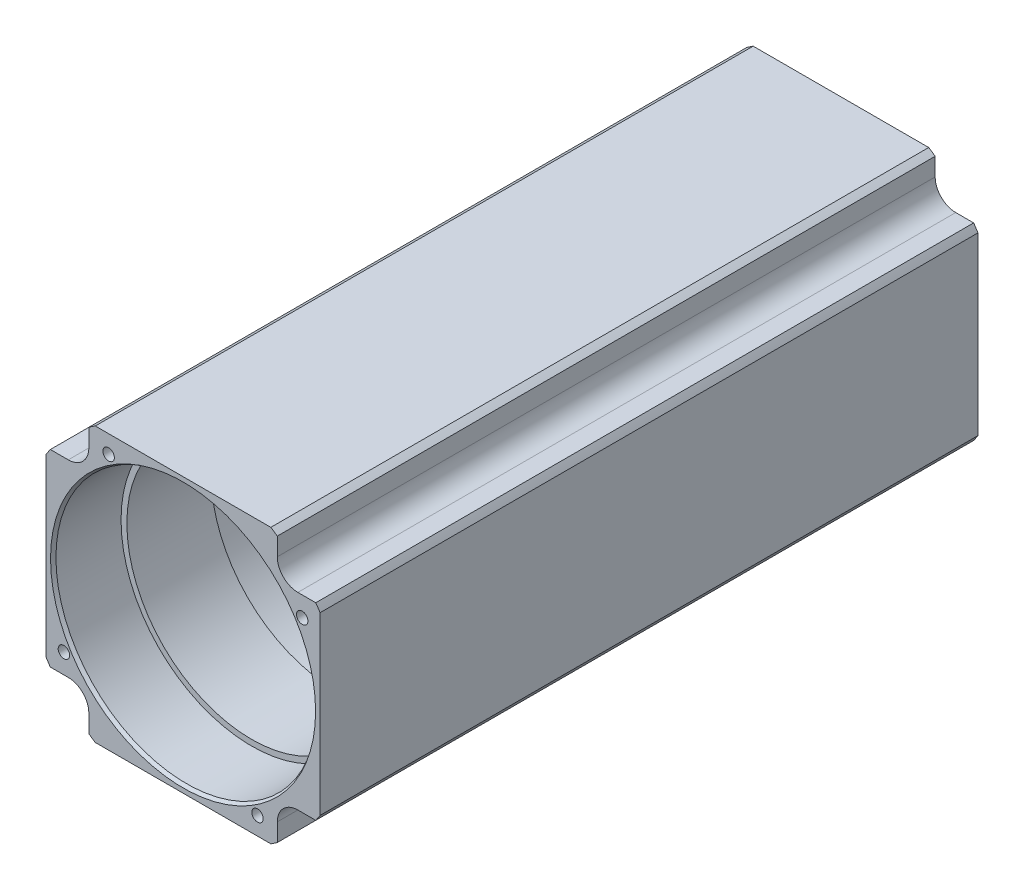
ISO-10303-21;
HEADER;
FILE_DESCRIPTION(('STEP AP214'),'2;1');
FILE_NAME('part.step','',(''),(''),'','','');
FILE_SCHEMA(('AUTOMOTIVE_DESIGN { 1 0 10303 214 1 1 1 1 }'));
ENDSEC;
DATA;
#1=APPLICATION_CONTEXT('core data for automotive mechanical design processes');
#2=APPLICATION_PROTOCOL_DEFINITION('international standard','automotive_design',2000,#1);
#3=PRODUCT_CONTEXT('',#1,'mechanical');
#4=PRODUCT('Part','Part','',(#3));
#5=PRODUCT_RELATED_PRODUCT_CATEGORY('part','',(#4));
#6=PRODUCT_DEFINITION_FORMATION('','',#4);
#7=PRODUCT_DEFINITION_CONTEXT('part definition',#1,'design');
#8=PRODUCT_DEFINITION('design','',#6,#7);
#9=PRODUCT_DEFINITION_SHAPE('','',#8);
#10=(LENGTH_UNIT() NAMED_UNIT(*) SI_UNIT(.MILLI.,.METRE.));
#11=(NAMED_UNIT(*) PLANE_ANGLE_UNIT() SI_UNIT($,.RADIAN.));
#12=(NAMED_UNIT(*) SI_UNIT($,.STERADIAN.) SOLID_ANGLE_UNIT());
#13=UNCERTAINTY_MEASURE_WITH_UNIT(LENGTH_MEASURE(1.E-05),#10,'distance_accuracy_value','');
#14=(GEOMETRIC_REPRESENTATION_CONTEXT(3) GLOBAL_UNCERTAINTY_ASSIGNED_CONTEXT((#13)) GLOBAL_UNIT_ASSIGNED_CONTEXT((#10,
#11,#12)) REPRESENTATION_CONTEXT('',''));
#15=CARTESIAN_POINT('',(0.,0.,0.));
#16=DIRECTION('',(0.,0.,1.));
#17=DIRECTION('',(1.,0.,0.));
#18=AXIS2_PLACEMENT_3D('',#15,#16,#17);
#19=CARTESIAN_POINT('',(17.3849859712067,10.8633449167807,87.9999999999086));
#20=DIRECTION('',(0.,0.,1.));
#21=DIRECTION('',(1.,0.,0.));
#22=AXIS2_PLACEMENT_3D('',#19,#20,#21);
#23=CONICAL_SURFACE('',#22,0.83759999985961,1.0297442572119);
#24=CARTESIAN_POINT('',(17.3849859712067,10.8633449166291,87.4967191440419));
#25=VERTEX_POINT('',#24);
#26=VERTEX_LOOP('',#25);
#27=FACE_BOUND('',#26,.T.);
#28=CARTESIAN_POINT('',(17.3849859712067,10.8633449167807,88.));
#29=DIRECTION('',(0.,0.,-1.));
#30=DIRECTION('',(-1.,0.,0.));
#31=AXIS2_PLACEMENT_3D('',#28,#29,#30);
#32=CIRCLE('',#31,0.8376);
#33=CARTESIAN_POINT('',(16.5473859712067,10.8633449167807,88.));
#34=VERTEX_POINT('',#33);
#35=EDGE_CURVE('E333',#34,#34,#32,.F.);
#36=ORIENTED_EDGE('',*,*,#35,.T.);
#37=EDGE_LOOP('',(#36));
#38=FACE_BOUND('',#37,.T.);
#39=ADVANCED_FACE('F17',(#27,#38),#23,.F.);
#40=CARTESIAN_POINT('',(10.8633449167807,-17.3849859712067,87.9999999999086));
#41=DIRECTION('',(0.,0.,1.));
#42=DIRECTION('',(1.,0.,0.));
#43=AXIS2_PLACEMENT_3D('',#40,#41,#42);
#44=CONICAL_SURFACE('',#43,0.83759999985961,1.0297442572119);
#45=CARTESIAN_POINT('',(10.8633449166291,-17.3849859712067,87.4967191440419));
#46=VERTEX_POINT('',#45);
#47=VERTEX_LOOP('',#46);
#48=FACE_BOUND('',#47,.T.);
#49=CARTESIAN_POINT('',(10.8633449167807,-17.3849859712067,88.));
#50=DIRECTION('',(0.,0.,-1.));
#51=DIRECTION('',(-1.,0.,0.));
#52=AXIS2_PLACEMENT_3D('',#49,#50,#51);
#53=CIRCLE('',#52,0.8376);
#54=CARTESIAN_POINT('',(10.0257449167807,-17.3849859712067,88.));
#55=VERTEX_POINT('',#54);
#56=EDGE_CURVE('E328',#55,#55,#53,.F.);
#57=ORIENTED_EDGE('',*,*,#56,.T.);
#58=EDGE_LOOP('',(#57));
#59=FACE_BOUND('',#58,.T.);
#60=ADVANCED_FACE('F655',(#48,#59),#44,.F.);
#61=CARTESIAN_POINT('',(-17.3849859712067,-10.8633449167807,87.9999999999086));
#62=DIRECTION('',(0.,0.,1.));
#63=DIRECTION('',(1.,0.,0.));
#64=AXIS2_PLACEMENT_3D('',#61,#62,#63);
#65=CONICAL_SURFACE('',#64,0.83759999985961,1.0297442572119);
#66=CARTESIAN_POINT('',(-17.3849859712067,-10.8633449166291,87.4967191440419));
#67=VERTEX_POINT('',#66);
#68=VERTEX_LOOP('',#67);
#69=FACE_BOUND('',#68,.T.);
#70=CARTESIAN_POINT('',(-17.3849859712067,-10.8633449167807,88.));
#71=DIRECTION('',(0.,0.,-1.));
#72=DIRECTION('',(-1.,0.,0.));
#73=AXIS2_PLACEMENT_3D('',#70,#71,#72);
#74=CIRCLE('',#73,0.8376);
#75=CARTESIAN_POINT('',(-18.2225859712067,-10.8633449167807,88.));
#76=VERTEX_POINT('',#75);
#77=EDGE_CURVE('E323',#76,#76,#74,.F.);
#78=ORIENTED_EDGE('',*,*,#77,.T.);
#79=EDGE_LOOP('',(#78));
#80=FACE_BOUND('',#79,.T.);
#81=ADVANCED_FACE('F652',(#69,#80),#65,.F.);
#82=CARTESIAN_POINT('',(-10.8633449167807,17.3849859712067,87.9999999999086));
#83=DIRECTION('',(0.,0.,1.));
#84=DIRECTION('',(1.,0.,0.));
#85=AXIS2_PLACEMENT_3D('',#82,#83,#84);
#86=CONICAL_SURFACE('',#85,0.83759999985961,1.0297442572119);
#87=CARTESIAN_POINT('',(-10.8633449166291,17.3849859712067,87.4967191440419));
#88=VERTEX_POINT('',#87);
#89=VERTEX_LOOP('',#88);
#90=FACE_BOUND('',#89,.T.);
#91=CARTESIAN_POINT('',(-10.8633449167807,17.3849859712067,88.));
#92=DIRECTION('',(0.,0.,-1.));
#93=DIRECTION('',(-1.,0.,0.));
#94=AXIS2_PLACEMENT_3D('',#91,#92,#93);
#95=CIRCLE('',#94,0.8376);
#96=CARTESIAN_POINT('',(-11.7009449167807,17.3849859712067,88.));
#97=VERTEX_POINT('',#96);
#98=EDGE_CURVE('E320',#97,#97,#95,.F.);
#99=ORIENTED_EDGE('',*,*,#98,.T.);
#100=EDGE_LOOP('',(#99));
#101=FACE_BOUND('',#100,.T.);
#102=ADVANCED_FACE('F648',(#90,#101),#86,.F.);
#103=CARTESIAN_POINT('',(17.3849859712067,10.8633449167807,96.));
#104=DIRECTION('',(0.,0.,-1.));
#105=DIRECTION('',(-1.,0.,0.));
#106=AXIS2_PLACEMENT_3D('',#103,#104,#105);
#107=CYLINDRICAL_SURFACE('',#106,0.8376);
#108=CARTESIAN_POINT('',(17.3849859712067,10.8633449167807,96.));
#109=DIRECTION('',(0.,0.,-1.));
#110=DIRECTION('',(-1.,0.,0.));
#111=AXIS2_PLACEMENT_3D('',#108,#109,#110);
#112=CIRCLE('',#111,0.8376);
#113=CARTESIAN_POINT('',(16.5473859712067,10.8633449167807,96.));
#114=VERTEX_POINT('',#113);
#115=EDGE_CURVE('E400',#114,#114,#112,.F.);
#116=ORIENTED_EDGE('',*,*,#115,.T.);
#117=EDGE_LOOP('',(#116));
#118=FACE_BOUND('',#117,.T.);
#119=ORIENTED_EDGE('',*,*,#35,.F.);
#120=EDGE_LOOP('',(#119));
#121=FACE_BOUND('',#120,.T.);
#122=ADVANCED_FACE('F644',(#118,#121),#107,.F.);
#123=CARTESIAN_POINT('',(10.8633449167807,-17.3849859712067,96.));
#124=DIRECTION('',(0.,0.,-1.));
#125=DIRECTION('',(-1.,0.,0.));
#126=AXIS2_PLACEMENT_3D('',#123,#124,#125);
#127=CYLINDRICAL_SURFACE('',#126,0.8376);
#128=CARTESIAN_POINT('',(10.8633449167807,-17.3849859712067,96.));
#129=DIRECTION('',(0.,0.,-1.));
#130=DIRECTION('',(-1.,0.,0.));
#131=AXIS2_PLACEMENT_3D('',#128,#129,#130);
#132=CIRCLE('',#131,0.8376);
#133=CARTESIAN_POINT('',(10.0257449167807,-17.3849859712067,96.));
#134=VERTEX_POINT('',#133);
#135=EDGE_CURVE('E397',#134,#134,#132,.F.);
#136=ORIENTED_EDGE('',*,*,#135,.T.);
#137=EDGE_LOOP('',(#136));
#138=FACE_BOUND('',#137,.T.);
#139=ORIENTED_EDGE('',*,*,#56,.F.);
#140=EDGE_LOOP('',(#139));
#141=FACE_BOUND('',#140,.T.);
#142=ADVANCED_FACE('F640',(#138,#141),#127,.F.);
#143=CARTESIAN_POINT('',(-17.3849859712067,-10.8633449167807,96.));
#144=DIRECTION('',(0.,0.,-1.));
#145=DIRECTION('',(-1.,0.,0.));
#146=AXIS2_PLACEMENT_3D('',#143,#144,#145);
#147=CYLINDRICAL_SURFACE('',#146,0.8376);
#148=CARTESIAN_POINT('',(-17.3849859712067,-10.8633449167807,96.));
#149=DIRECTION('',(0.,0.,-1.));
#150=DIRECTION('',(-1.,0.,0.));
#151=AXIS2_PLACEMENT_3D('',#148,#149,#150);
#152=CIRCLE('',#151,0.8376);
#153=CARTESIAN_POINT('',(-18.2225859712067,-10.8633449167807,96.));
#154=VERTEX_POINT('',#153);
#155=EDGE_CURVE('E394',#154,#154,#152,.F.);
#156=ORIENTED_EDGE('',*,*,#155,.T.);
#157=EDGE_LOOP('',(#156));
#158=FACE_BOUND('',#157,.T.);
#159=ORIENTED_EDGE('',*,*,#77,.F.);
#160=EDGE_LOOP('',(#159));
#161=FACE_BOUND('',#160,.T.);
#162=ADVANCED_FACE('F636',(#158,#161),#147,.F.);
#163=CARTESIAN_POINT('',(-10.8633449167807,17.3849859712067,96.));
#164=DIRECTION('',(0.,0.,-1.));
#165=DIRECTION('',(-1.,0.,0.));
#166=AXIS2_PLACEMENT_3D('',#163,#164,#165);
#167=CYLINDRICAL_SURFACE('',#166,0.8376);
#168=CARTESIAN_POINT('',(-10.8633449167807,17.3849859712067,96.));
#169=DIRECTION('',(0.,0.,-1.));
#170=DIRECTION('',(-1.,0.,0.));
#171=AXIS2_PLACEMENT_3D('',#168,#169,#170);
#172=CIRCLE('',#171,0.8376);
#173=CARTESIAN_POINT('',(-11.7009449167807,17.3849859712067,96.));
#174=VERTEX_POINT('',#173);
#175=EDGE_CURVE('E388',#174,#174,#172,.F.);
#176=ORIENTED_EDGE('',*,*,#175,.T.);
#177=EDGE_LOOP('',(#176));
#178=FACE_BOUND('',#177,.T.);
#179=ORIENTED_EDGE('',*,*,#98,.F.);
#180=EDGE_LOOP('',(#179));
#181=FACE_BOUND('',#180,.T.);
#182=ADVANCED_FACE('F632',(#178,#181),#167,.F.);
#183=CARTESIAN_POINT('',(0.,0.,96.));
#184=DIRECTION('',(0.,0.,1.));
#185=DIRECTION('',(1.,0.,0.));
#186=AXIS2_PLACEMENT_3D('',#183,#184,#185);
#187=CONICAL_SURFACE('',#186,19.3386751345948,0.523598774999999);
#188=CARTESIAN_POINT('',(0.,0.,96.));
#189=DIRECTION('',(0.,0.,1.));
#190=DIRECTION('',(1.,0.,0.));
#191=AXIS2_PLACEMENT_3D('',#188,#189,#190);
#192=CIRCLE('',#191,19.3386751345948);
#193=CARTESIAN_POINT('',(19.3386751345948,0.,96.));
#194=VERTEX_POINT('',#193);
#195=EDGE_CURVE('E391',#194,#194,#192,.T.);
#196=ORIENTED_EDGE('',*,*,#195,.T.);
#197=EDGE_LOOP('',(#196));
#198=FACE_BOUND('',#197,.T.);
#199=CARTESIAN_POINT('',(0.,0.,95.5));
#200=DIRECTION('',(0.,0.,-1.));
#201=DIRECTION('',(-1.,0.,0.));
#202=AXIS2_PLACEMENT_3D('',#199,#200,#201);
#203=CIRCLE('',#202,19.05);
#204=CARTESIAN_POINT('',(-19.05,0.,95.5));
#205=VERTEX_POINT('',#204);
#206=EDGE_CURVE('E162',#205,#205,#203,.T.);
#207=ORIENTED_EDGE('',*,*,#206,.T.);
#208=EDGE_LOOP('',(#207));
#209=FACE_BOUND('',#208,.T.);
#210=ADVANCED_FACE('F628',(#198,#209),#187,.F.);
#211=CARTESIAN_POINT('',(11.6312123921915,17.2439815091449,8.00000000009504));
#212=DIRECTION('',(0.,0.,-1.));
#213=DIRECTION('',(-1.,0.,0.));
#214=AXIS2_PLACEMENT_3D('',#211,#212,#213);
#215=CONICAL_SURFACE('',#214,0.837599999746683,1.02974425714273);
#216=CARTESIAN_POINT('',(11.6312123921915,17.2439815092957,8.50328085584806));
#217=VERTEX_POINT('',#216);
#218=VERTEX_LOOP('',#217);
#219=FACE_BOUND('',#218,.T.);
#220=CARTESIAN_POINT('',(11.6312123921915,17.2439815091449,8.));
#221=DIRECTION('',(0.,0.,1.));
#222=DIRECTION('',(1.,0.,0.));
#223=AXIS2_PLACEMENT_3D('',#220,#221,#222);
#224=CIRCLE('',#223,0.8376);
#225=CARTESIAN_POINT('',(12.4688123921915,17.2439815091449,8.));
#226=VERTEX_POINT('',#225);
#227=EDGE_CURVE('E286',#226,#226,#224,.F.);
#228=ORIENTED_EDGE('',*,*,#227,.T.);
#229=EDGE_LOOP('',(#228));
#230=FACE_BOUND('',#229,.T.);
#231=ADVANCED_FACE('F624',(#219,#230),#215,.F.);
#232=CARTESIAN_POINT('',(17.2439815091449,-11.6312123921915,8.00000000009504));
#233=DIRECTION('',(0.,0.,-1.));
#234=DIRECTION('',(-1.,0.,0.));
#235=AXIS2_PLACEMENT_3D('',#232,#233,#234);
#236=CONICAL_SURFACE('',#235,0.837599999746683,1.02974425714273);
#237=CARTESIAN_POINT('',(17.2439815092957,-11.6312123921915,8.50328085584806));
#238=VERTEX_POINT('',#237);
#239=VERTEX_LOOP('',#238);
#240=FACE_BOUND('',#239,.T.);
#241=CARTESIAN_POINT('',(17.2439815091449,-11.6312123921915,8.));
#242=DIRECTION('',(0.,0.,1.));
#243=DIRECTION('',(1.,0.,0.));
#244=AXIS2_PLACEMENT_3D('',#241,#242,#243);
#245=CIRCLE('',#244,0.8376);
#246=CARTESIAN_POINT('',(18.0815815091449,-11.6312123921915,8.));
#247=VERTEX_POINT('',#246);
#248=EDGE_CURVE('E281',#247,#247,#245,.F.);
#249=ORIENTED_EDGE('',*,*,#248,.T.);
#250=EDGE_LOOP('',(#249));
#251=FACE_BOUND('',#250,.T.);
#252=ADVANCED_FACE('F620',(#240,#251),#236,.F.);
#253=CARTESIAN_POINT('',(-11.6312123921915,-17.2439815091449,8.00000000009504));
#254=DIRECTION('',(0.,0.,-1.));
#255=DIRECTION('',(-1.,0.,0.));
#256=AXIS2_PLACEMENT_3D('',#253,#254,#255);
#257=CONICAL_SURFACE('',#256,0.837599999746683,1.02974425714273);
#258=CARTESIAN_POINT('',(-11.6312123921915,-17.2439815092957,8.50328085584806));
#259=VERTEX_POINT('',#258);
#260=VERTEX_LOOP('',#259);
#261=FACE_BOUND('',#260,.T.);
#262=CARTESIAN_POINT('',(-11.6312123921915,-17.2439815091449,8.));
#263=DIRECTION('',(0.,0.,1.));
#264=DIRECTION('',(1.,0.,0.));
#265=AXIS2_PLACEMENT_3D('',#262,#263,#264);
#266=CIRCLE('',#265,0.8376);
#267=CARTESIAN_POINT('',(-10.7936123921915,-17.2439815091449,8.));
#268=VERTEX_POINT('',#267);
#269=EDGE_CURVE('E276',#268,#268,#266,.F.);
#270=ORIENTED_EDGE('',*,*,#269,.T.);
#271=EDGE_LOOP('',(#270));
#272=FACE_BOUND('',#271,.T.);
#273=ADVANCED_FACE('F616',(#261,#272),#257,.F.);
#274=CARTESIAN_POINT('',(-17.2439815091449,11.6312123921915,8.00000000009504));
#275=DIRECTION('',(0.,0.,-1.));
#276=DIRECTION('',(-1.,0.,0.));
#277=AXIS2_PLACEMENT_3D('',#274,#275,#276);
#278=CONICAL_SURFACE('',#277,0.837599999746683,1.02974425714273);
#279=CARTESIAN_POINT('',(-17.2439815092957,11.6312123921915,8.50328085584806));
#280=VERTEX_POINT('',#279);
#281=VERTEX_LOOP('',#280);
#282=FACE_BOUND('',#281,.T.);
#283=CARTESIAN_POINT('',(-17.2439815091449,11.6312123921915,8.));
#284=DIRECTION('',(0.,0.,1.));
#285=DIRECTION('',(1.,0.,0.));
#286=AXIS2_PLACEMENT_3D('',#283,#284,#285);
#287=CIRCLE('',#286,0.8376);
#288=CARTESIAN_POINT('',(-16.4063815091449,11.6312123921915,8.));
#289=VERTEX_POINT('',#288);
#290=EDGE_CURVE('E273',#289,#289,#287,.F.);
#291=ORIENTED_EDGE('',*,*,#290,.T.);
#292=EDGE_LOOP('',(#291));
#293=FACE_BOUND('',#292,.T.);
#294=ADVANCED_FACE('F613',(#282,#293),#278,.F.);
#295=CARTESIAN_POINT('',(0.,0.,0.));
#296=DIRECTION('',(0.,0.,1.));
#297=DIRECTION('',(1.,0.,0.));
#298=AXIS2_PLACEMENT_3D('',#295,#296,#297);
#299=CYLINDRICAL_SURFACE('',#298,23.75);
#300=CARTESIAN_POINT('',(0.,0.,96.));
#301=DIRECTION('',(0.,0.,1.));
#302=DIRECTION('',(1.,0.,0.));
#303=AXIS2_PLACEMENT_3D('',#300,#301,#302);
#304=CIRCLE('',#303,23.75);
#305=CARTESIAN_POINT('',(-20.,12.8086884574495,96.));
#306=VERTEX_POINT('',#305);
#307=CARTESIAN_POINT('',(-19.3649167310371,13.7499999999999,96.));
#308=VERTEX_POINT('',#307);
#309=EDGE_CURVE('E403',#306,#308,#304,.F.);
#310=ORIENTED_EDGE('',*,*,#309,.T.);
#311=DIRECTION('',(0.,0.,-1.));
#312=VECTOR('',#311,1.);
#313=CARTESIAN_POINT('',(-19.3649167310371,13.7499999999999,96.));
#314=LINE('',#313,#312);
#315=CARTESIAN_POINT('',(-19.3649167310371,13.7499999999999,0.));
#316=VERTEX_POINT('',#315);
#317=EDGE_CURVE('E269',#308,#316,#314,.T.);
#318=ORIENTED_EDGE('',*,*,#317,.T.);
#319=CARTESIAN_POINT('',(0.,0.,0.));
#320=DIRECTION('',(0.,0.,1.));
#321=DIRECTION('',(1.,0.,0.));
#322=AXIS2_PLACEMENT_3D('',#319,#320,#321);
#323=CIRCLE('',#322,23.75);
#324=CARTESIAN_POINT('',(-20.,12.8086884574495,0.));
#325=VERTEX_POINT('',#324);
#326=EDGE_CURVE('E20',#316,#325,#323,.T.);
#327=ORIENTED_EDGE('',*,*,#326,.T.);
#328=DIRECTION('',(0.,0.,1.));
#329=VECTOR('',#328,1.);
#330=CARTESIAN_POINT('',(-20.,12.8086884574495,96.));
#331=LINE('',#330,#329);
#332=EDGE_CURVE('E172',#325,#306,#331,.T.);
#333=ORIENTED_EDGE('',*,*,#332,.T.);
#334=EDGE_LOOP('',(#310,#318,#327,#333));
#335=FACE_BOUND('',#334,.T.);
#336=ADVANCED_FACE('F610',(#335),#299,.T.);
#337=CARTESIAN_POINT('',(0.,0.,0.));
#338=DIRECTION('',(0.,0.,1.));
#339=DIRECTION('',(1.,0.,0.));
#340=AXIS2_PLACEMENT_3D('',#337,#338,#339);
#341=CYLINDRICAL_SURFACE('',#340,23.75);
#342=CARTESIAN_POINT('',(0.,0.,96.));
#343=DIRECTION('',(0.,0.,1.));
#344=DIRECTION('',(1.,0.,0.));
#345=AXIS2_PLACEMENT_3D('',#342,#343,#344);
#346=CIRCLE('',#345,23.75);
#347=CARTESIAN_POINT('',(-13.75,19.3649167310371,96.));
#348=VERTEX_POINT('',#347);
#349=CARTESIAN_POINT('',(-12.8086884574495,20.,96.));
#350=VERTEX_POINT('',#349);
#351=EDGE_CURVE('E418',#348,#350,#346,.F.);
#352=ORIENTED_EDGE('',*,*,#351,.T.);
#353=DIRECTION('',(0.,0.,1.));
#354=VECTOR('',#353,1.);
#355=CARTESIAN_POINT('',(-12.8086884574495,20.,96.));
#356=LINE('',#355,#354);
#357=CARTESIAN_POINT('',(-12.8086884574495,20.,0.));
#358=VERTEX_POINT('',#357);
#359=EDGE_CURVE('E248',#350,#358,#356,.F.);
#360=ORIENTED_EDGE('',*,*,#359,.T.);
#361=CARTESIAN_POINT('',(0.,0.,0.));
#362=DIRECTION('',(0.,0.,1.));
#363=DIRECTION('',(1.,0.,0.));
#364=AXIS2_PLACEMENT_3D('',#361,#362,#363);
#365=CIRCLE('',#364,23.75);
#366=CARTESIAN_POINT('',(-13.75,19.3649167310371,0.));
#367=VERTEX_POINT('',#366);
#368=EDGE_CURVE('E429',#358,#367,#365,.T.);
#369=ORIENTED_EDGE('',*,*,#368,.T.);
#370=DIRECTION('',(0.,0.,-1.));
#371=VECTOR('',#370,1.);
#372=CARTESIAN_POINT('',(-13.75,19.3649167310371,96.));
#373=LINE('',#372,#371);
#374=EDGE_CURVE('E260',#367,#348,#373,.F.);
#375=ORIENTED_EDGE('',*,*,#374,.T.);
#376=EDGE_LOOP('',(#352,#360,#369,#375));
#377=FACE_BOUND('',#376,.T.);
#378=ADVANCED_FACE('F435',(#377),#341,.T.);
#379=CARTESIAN_POINT('',(0.,0.,0.));
#380=DIRECTION('',(0.,0.,1.));
#381=DIRECTION('',(1.,0.,0.));
#382=AXIS2_PLACEMENT_3D('',#379,#380,#381);
#383=CYLINDRICAL_SURFACE('',#382,23.75);
#384=DIRECTION('',(0.,0.,1.));
#385=VECTOR('',#384,1.);
#386=CARTESIAN_POINT('',(12.8086884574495,20.,96.));
#387=LINE('',#386,#385);
#388=CARTESIAN_POINT('',(12.8086884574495,20.,0.));
#389=VERTEX_POINT('',#388);
#390=CARTESIAN_POINT('',(12.8086884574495,20.,96.));
#391=VERTEX_POINT('',#390);
#392=EDGE_CURVE('E247',#389,#391,#387,.T.);
#393=ORIENTED_EDGE('',*,*,#392,.T.);
#394=CARTESIAN_POINT('',(0.,0.,96.));
#395=DIRECTION('',(0.,0.,1.));
#396=DIRECTION('',(1.,0.,0.));
#397=AXIS2_PLACEMENT_3D('',#394,#395,#396);
#398=CIRCLE('',#397,23.75);
#399=CARTESIAN_POINT('',(13.75,19.3649167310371,96.));
#400=VERTEX_POINT('',#399);
#401=EDGE_CURVE('E415',#391,#400,#398,.F.);
#402=ORIENTED_EDGE('',*,*,#401,.T.);
#403=DIRECTION('',(0.,0.,-1.));
#404=VECTOR('',#403,1.);
#405=CARTESIAN_POINT('',(13.75,19.3649167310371,96.));
#406=LINE('',#405,#404);
#407=CARTESIAN_POINT('',(13.75,19.3649167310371,0.));
#408=VERTEX_POINT('',#407);
#409=EDGE_CURVE('E243',#408,#400,#406,.F.);
#410=ORIENTED_EDGE('',*,*,#409,.F.);
#411=CARTESIAN_POINT('',(0.,0.,0.));
#412=DIRECTION('',(0.,0.,1.));
#413=DIRECTION('',(1.,0.,0.));
#414=AXIS2_PLACEMENT_3D('',#411,#412,#413);
#415=CIRCLE('',#414,23.75);
#416=EDGE_CURVE('E428',#408,#389,#415,.T.);
#417=ORIENTED_EDGE('',*,*,#416,.T.);
#418=EDGE_LOOP('',(#393,#402,#410,#417));
#419=FACE_BOUND('',#418,.T.);
#420=ADVANCED_FACE('F603',(#419),#383,.T.);
#421=CARTESIAN_POINT('',(0.,0.,0.));
#422=DIRECTION('',(0.,0.,1.));
#423=DIRECTION('',(1.,0.,0.));
#424=AXIS2_PLACEMENT_3D('',#421,#422,#423);
#425=CYLINDRICAL_SURFACE('',#424,23.75);
#426=DIRECTION('',(0.,0.,1.));
#427=VECTOR('',#426,1.);
#428=CARTESIAN_POINT('',(20.0000000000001,12.8086884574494,96.));
#429=LINE('',#428,#427);
#430=CARTESIAN_POINT('',(20.0000000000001,12.8086884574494,96.));
#431=VERTEX_POINT('',#430);
#432=CARTESIAN_POINT('',(20.,12.8086884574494,0.));
#433=VERTEX_POINT('',#432);
#434=EDGE_CURVE('E222',#431,#433,#429,.F.);
#435=ORIENTED_EDGE('',*,*,#434,.T.);
#436=CARTESIAN_POINT('',(0.,0.,0.));
#437=DIRECTION('',(0.,0.,1.));
#438=DIRECTION('',(1.,0.,0.));
#439=AXIS2_PLACEMENT_3D('',#436,#437,#438);
#440=CIRCLE('',#439,23.75);
#441=CARTESIAN_POINT('',(19.3649167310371,13.7499999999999,0.));
#442=VERTEX_POINT('',#441);
#443=EDGE_CURVE('E426',#433,#442,#440,.T.);
#444=ORIENTED_EDGE('',*,*,#443,.T.);
#445=DIRECTION('',(0.,0.,1.));
#446=VECTOR('',#445,1.);
#447=CARTESIAN_POINT('',(19.3649167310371,13.7499999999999,96.));
#448=LINE('',#447,#446);
#449=CARTESIAN_POINT('',(19.3649167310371,13.7499999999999,96.));
#450=VERTEX_POINT('',#449);
#451=EDGE_CURVE('E234',#450,#442,#448,.F.);
#452=ORIENTED_EDGE('',*,*,#451,.F.);
#453=CARTESIAN_POINT('',(0.,0.,96.));
#454=DIRECTION('',(0.,0.,1.));
#455=DIRECTION('',(1.,0.,0.));
#456=AXIS2_PLACEMENT_3D('',#453,#454,#455);
#457=CIRCLE('',#456,23.75);
#458=EDGE_CURVE('E413',#450,#431,#457,.F.);
#459=ORIENTED_EDGE('',*,*,#458,.T.);
#460=EDGE_LOOP('',(#435,#444,#452,#459));
#461=FACE_BOUND('',#460,.T.);
#462=ADVANCED_FACE('F599',(#461),#425,.T.);
#463=CARTESIAN_POINT('',(0.,0.,0.));
#464=DIRECTION('',(0.,0.,1.));
#465=DIRECTION('',(1.,0.,0.));
#466=AXIS2_PLACEMENT_3D('',#463,#464,#465);
#467=CYLINDRICAL_SURFACE('',#466,23.75);
#468=CARTESIAN_POINT('',(0.,0.,96.));
#469=DIRECTION('',(0.,0.,1.));
#470=DIRECTION('',(1.,0.,0.));
#471=AXIS2_PLACEMENT_3D('',#468,#469,#470);
#472=CIRCLE('',#471,23.75);
#473=CARTESIAN_POINT('',(20.,-12.8086884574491,96.));
#474=VERTEX_POINT('',#473);
#475=CARTESIAN_POINT('',(19.364916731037,-13.7500000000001,96.));
#476=VERTEX_POINT('',#475);
#477=EDGE_CURVE('E411',#474,#476,#472,.F.);
#478=ORIENTED_EDGE('',*,*,#477,.T.);
#479=DIRECTION('',(0.,0.,1.));
#480=VECTOR('',#479,1.);
#481=CARTESIAN_POINT('',(19.364916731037,-13.7500000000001,96.));
#482=LINE('',#481,#480);
#483=CARTESIAN_POINT('',(19.364916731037,-13.7500000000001,0.));
#484=VERTEX_POINT('',#483);
#485=EDGE_CURVE('E217',#476,#484,#482,.F.);
#486=ORIENTED_EDGE('',*,*,#485,.T.);
#487=CARTESIAN_POINT('',(0.,0.,0.));
#488=DIRECTION('',(0.,0.,1.));
#489=DIRECTION('',(1.,0.,0.));
#490=AXIS2_PLACEMENT_3D('',#487,#488,#489);
#491=CIRCLE('',#490,23.75);
#492=CARTESIAN_POINT('',(20.,-12.8086884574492,0.));
#493=VERTEX_POINT('',#492);
#494=EDGE_CURVE('E424',#484,#493,#491,.T.);
#495=ORIENTED_EDGE('',*,*,#494,.T.);
#496=DIRECTION('',(0.,0.,1.));
#497=VECTOR('',#496,1.);
#498=CARTESIAN_POINT('',(20.,-12.8086884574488,96.));
#499=LINE('',#498,#497);
#500=EDGE_CURVE('E225',#493,#474,#499,.T.);
#501=ORIENTED_EDGE('',*,*,#500,.T.);
#502=EDGE_LOOP('',(#478,#486,#495,#501));
#503=FACE_BOUND('',#502,.T.);
#504=ADVANCED_FACE('F595',(#503),#467,.T.);
#505=CARTESIAN_POINT('',(0.,0.,0.));
#506=DIRECTION('',(0.,0.,1.));
#507=DIRECTION('',(1.,0.,0.));
#508=AXIS2_PLACEMENT_3D('',#505,#506,#507);
#509=CYLINDRICAL_SURFACE('',#508,23.75);
#510=CARTESIAN_POINT('',(0.,0.,96.));
#511=DIRECTION('',(0.,0.,1.));
#512=DIRECTION('',(1.,0.,0.));
#513=AXIS2_PLACEMENT_3D('',#510,#511,#512);
#514=CIRCLE('',#513,23.75);
#515=CARTESIAN_POINT('',(13.75,-19.3649167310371,96.));
#516=VERTEX_POINT('',#515);
#517=CARTESIAN_POINT('',(12.8086884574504,-19.9999999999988,96.));
#518=VERTEX_POINT('',#517);
#519=EDGE_CURVE('E408',#516,#518,#514,.F.);
#520=ORIENTED_EDGE('',*,*,#519,.T.);
#521=DIRECTION('',(0.,0.,1.));
#522=VECTOR('',#521,1.);
#523=CARTESIAN_POINT('',(12.8086884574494,-19.9999999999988,96.));
#524=LINE('',#523,#522);
#525=CARTESIAN_POINT('',(12.8086884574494,-19.9999999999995,0.));
#526=VERTEX_POINT('',#525);
#527=EDGE_CURVE('E201',#526,#518,#524,.T.);
#528=ORIENTED_EDGE('',*,*,#527,.F.);
#529=CARTESIAN_POINT('',(0.,0.,0.));
#530=DIRECTION('',(0.,0.,1.));
#531=DIRECTION('',(1.,0.,0.));
#532=AXIS2_PLACEMENT_3D('',#529,#530,#531);
#533=CIRCLE('',#532,23.75);
#534=CARTESIAN_POINT('',(13.75,-19.3649167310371,0.));
#535=VERTEX_POINT('',#534);
#536=EDGE_CURVE('E422',#526,#535,#533,.T.);
#537=ORIENTED_EDGE('',*,*,#536,.T.);
#538=DIRECTION('',(0.,0.,1.));
#539=VECTOR('',#538,1.);
#540=CARTESIAN_POINT('',(13.75,-19.3649167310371,96.));
#541=LINE('',#540,#539);
#542=EDGE_CURVE('E204',#535,#516,#541,.T.);
#543=ORIENTED_EDGE('',*,*,#542,.T.);
#544=EDGE_LOOP('',(#520,#528,#537,#543));
#545=FACE_BOUND('',#544,.T.);
#546=ADVANCED_FACE('F591',(#545),#509,.T.);
#547=CARTESIAN_POINT('',(0.,0.,0.));
#548=DIRECTION('',(0.,0.,1.));
#549=DIRECTION('',(1.,0.,0.));
#550=AXIS2_PLACEMENT_3D('',#547,#548,#549);
#551=CYLINDRICAL_SURFACE('',#550,23.75);
#552=DIRECTION('',(0.,0.,1.));
#553=VECTOR('',#552,1.);
#554=CARTESIAN_POINT('',(-13.75,-19.3649167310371,96.));
#555=LINE('',#554,#553);
#556=CARTESIAN_POINT('',(-13.75,-19.3649167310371,0.));
#557=VERTEX_POINT('',#556);
#558=CARTESIAN_POINT('',(-13.75,-19.3649167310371,96.));
#559=VERTEX_POINT('',#558);
#560=EDGE_CURVE('E197',#557,#559,#555,.T.);
#561=ORIENTED_EDGE('',*,*,#560,.F.);
#562=CARTESIAN_POINT('',(0.,0.,0.));
#563=DIRECTION('',(0.,0.,1.));
#564=DIRECTION('',(1.,0.,0.));
#565=AXIS2_PLACEMENT_3D('',#562,#563,#564);
#566=CIRCLE('',#565,23.75);
#567=CARTESIAN_POINT('',(-12.8086884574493,-20.0000000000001,0.));
#568=VERTEX_POINT('',#567);
#569=EDGE_CURVE('E420',#557,#568,#566,.T.);
#570=ORIENTED_EDGE('',*,*,#569,.T.);
#571=DIRECTION('',(0.,0.,1.));
#572=VECTOR('',#571,1.);
#573=CARTESIAN_POINT('',(-12.8086884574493,-20.0000000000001,96.));
#574=LINE('',#573,#572);
#575=CARTESIAN_POINT('',(-12.8086884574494,-20.0000000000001,96.));
#576=VERTEX_POINT('',#575);
#577=EDGE_CURVE('E200',#576,#568,#574,.F.);
#578=ORIENTED_EDGE('',*,*,#577,.F.);
#579=CARTESIAN_POINT('',(0.,0.,96.));
#580=DIRECTION('',(0.,0.,1.));
#581=DIRECTION('',(1.,0.,0.));
#582=AXIS2_PLACEMENT_3D('',#579,#580,#581);
#583=CIRCLE('',#582,23.75);
#584=EDGE_CURVE('E405',#576,#559,#583,.F.);
#585=ORIENTED_EDGE('',*,*,#584,.T.);
#586=EDGE_LOOP('',(#561,#570,#578,#585));
#587=FACE_BOUND('',#586,.T.);
#588=ADVANCED_FACE('F587',(#587),#551,.T.);
#589=CARTESIAN_POINT('',(16.7499999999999,16.7499999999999,96.));
#590=DIRECTION('',(0.,0.,-1.));
#591=DIRECTION('',(-1.,0.,0.));
#592=AXIS2_PLACEMENT_3D('',#589,#590,#591);
#593=PLANE('',#592);
#594=ORIENTED_EDGE('',*,*,#175,.F.);
#595=EDGE_LOOP('',(#594));
#596=FACE_BOUND('',#595,.T.);
#597=ORIENTED_EDGE('',*,*,#195,.F.);
#598=EDGE_LOOP('',(#597));
#599=FACE_BOUND('',#598,.T.);
#600=ORIENTED_EDGE('',*,*,#155,.F.);
#601=EDGE_LOOP('',(#600));
#602=FACE_BOUND('',#601,.T.);
#603=ORIENTED_EDGE('',*,*,#135,.F.);
#604=EDGE_LOOP('',(#603));
#605=FACE_BOUND('',#604,.T.);
#606=ORIENTED_EDGE('',*,*,#115,.F.);
#607=EDGE_LOOP('',(#606));
#608=FACE_BOUND('',#607,.T.);
#609=DIRECTION('',(0.,1.,0.));
#610=VECTOR('',#609,1.);
#611=CARTESIAN_POINT('',(-20.,13.7499999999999,96.));
#612=LINE('',#611,#610);
#613=CARTESIAN_POINT('',(-19.9999999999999,-12.8086884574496,96.));
#614=VERTEX_POINT('',#613);
#615=EDGE_CURVE('E173',#306,#614,#612,.F.);
#616=ORIENTED_EDGE('',*,*,#615,.T.);
#617=CARTESIAN_POINT('',(0.,0.,96.));
#618=DIRECTION('',(0.,0.,1.));
#619=DIRECTION('',(1.,0.,0.));
#620=AXIS2_PLACEMENT_3D('',#617,#618,#619);
#621=CIRCLE('',#620,23.75);
#622=CARTESIAN_POINT('',(-19.364916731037,-13.7500000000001,96.));
#623=VERTEX_POINT('',#622);
#624=EDGE_CURVE('E163',#623,#614,#621,.F.);
#625=ORIENTED_EDGE('',*,*,#624,.F.);
#626=DIRECTION('',(1.,0.,0.));
#627=VECTOR('',#626,1.);
#628=CARTESIAN_POINT('',(-16.7499999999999,-13.7500000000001,96.));
#629=LINE('',#628,#627);
#630=CARTESIAN_POINT('',(-16.7499999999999,-13.7500000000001,96.));
#631=VERTEX_POINT('',#630);
#632=EDGE_CURVE('E192',#631,#623,#629,.F.);
#633=ORIENTED_EDGE('',*,*,#632,.F.);
#634=CARTESIAN_POINT('',(-16.7499999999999,-16.7500000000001,96.));
#635=DIRECTION('',(0.,0.,-1.));
#636=DIRECTION('',(-1.,0.,0.));
#637=AXIS2_PLACEMENT_3D('',#634,#635,#636);
#638=CIRCLE('',#637,2.99999999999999);
#639=CARTESIAN_POINT('',(-13.75,-16.7500000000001,96.));
#640=VERTEX_POINT('',#639);
#641=EDGE_CURVE('E196',#631,#640,#638,.T.);
#642=ORIENTED_EDGE('',*,*,#641,.T.);
#643=DIRECTION('',(0.,1.,0.));
#644=VECTOR('',#643,1.);
#645=CARTESIAN_POINT('',(-13.75,-20.0000000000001,96.));
#646=LINE('',#645,#644);
#647=EDGE_CURVE('E199',#559,#640,#646,.T.);
#648=ORIENTED_EDGE('',*,*,#647,.F.);
#649=ORIENTED_EDGE('',*,*,#584,.F.);
#650=DIRECTION('',(1.,0.,0.));
#651=VECTOR('',#650,1.);
#652=CARTESIAN_POINT('',(-11.75,-20.,96.));
#653=LINE('',#652,#651);
#654=EDGE_CURVE('E203',#518,#576,#653,.F.);
#655=ORIENTED_EDGE('',*,*,#654,.F.);
#656=ORIENTED_EDGE('',*,*,#519,.F.);
#657=DIRECTION('',(0.,1.,0.));
#658=VECTOR('',#657,1.);
#659=CARTESIAN_POINT('',(13.75,-20.0000000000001,96.));
#660=LINE('',#659,#658);
#661=CARTESIAN_POINT('',(13.75,-16.7500000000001,96.));
#662=VERTEX_POINT('',#661);
#663=EDGE_CURVE('E210',#516,#662,#660,.T.);
#664=ORIENTED_EDGE('',*,*,#663,.T.);
#665=CARTESIAN_POINT('',(16.7499999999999,-16.7500000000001,96.));
#666=DIRECTION('',(0.,0.,-1.));
#667=DIRECTION('',(-1.,0.,0.));
#668=AXIS2_PLACEMENT_3D('',#665,#666,#667);
#669=CIRCLE('',#668,2.99999999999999);
#670=CARTESIAN_POINT('',(16.7499999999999,-13.7500000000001,96.));
#671=VERTEX_POINT('',#670);
#672=EDGE_CURVE('E216',#662,#671,#669,.T.);
#673=ORIENTED_EDGE('',*,*,#672,.T.);
#674=DIRECTION('',(1.,0.,0.));
#675=VECTOR('',#674,1.);
#676=CARTESIAN_POINT('',(16.7499999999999,-13.7500000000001,96.));
#677=LINE('',#676,#675);
#678=EDGE_CURVE('E221',#671,#476,#677,.T.);
#679=ORIENTED_EDGE('',*,*,#678,.T.);
#680=ORIENTED_EDGE('',*,*,#477,.F.);
#681=DIRECTION('',(0.,-1.,0.));
#682=VECTOR('',#681,1.);
#683=CARTESIAN_POINT('',(20.,-13.7500000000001,96.));
#684=LINE('',#683,#682);
#685=EDGE_CURVE('E226',#474,#431,#684,.F.);
#686=ORIENTED_EDGE('',*,*,#685,.T.);
#687=ORIENTED_EDGE('',*,*,#458,.F.);
#688=DIRECTION('',(1.,0.,0.));
#689=VECTOR('',#688,1.);
#690=CARTESIAN_POINT('',(16.7499999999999,13.7499999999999,96.));
#691=LINE('',#690,#689);
#692=CARTESIAN_POINT('',(16.7499999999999,13.7499999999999,96.));
#693=VERTEX_POINT('',#692);
#694=EDGE_CURVE('E237',#693,#450,#691,.T.);
#695=ORIENTED_EDGE('',*,*,#694,.F.);
#696=CARTESIAN_POINT('',(16.7499999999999,16.7499999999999,96.));
#697=DIRECTION('',(0.,0.,-1.));
#698=DIRECTION('',(-1.,0.,0.));
#699=AXIS2_PLACEMENT_3D('',#696,#697,#698);
#700=CIRCLE('',#699,2.99999999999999);
#701=CARTESIAN_POINT('',(13.75,16.7499999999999,96.));
#702=VERTEX_POINT('',#701);
#703=EDGE_CURVE('E242',#693,#702,#700,.T.);
#704=ORIENTED_EDGE('',*,*,#703,.T.);
#705=DIRECTION('',(0.,1.,0.));
#706=VECTOR('',#705,1.);
#707=CARTESIAN_POINT('',(13.75,20.,96.));
#708=LINE('',#707,#706);
#709=EDGE_CURVE('E246',#400,#702,#708,.F.);
#710=ORIENTED_EDGE('',*,*,#709,.F.);
#711=ORIENTED_EDGE('',*,*,#401,.F.);
#712=DIRECTION('',(1.,0.,0.));
#713=VECTOR('',#712,1.);
#714=CARTESIAN_POINT('',(0.,20.,96.));
#715=LINE('',#714,#713);
#716=EDGE_CURVE('E252',#391,#350,#715,.F.);
#717=ORIENTED_EDGE('',*,*,#716,.T.);
#718=ORIENTED_EDGE('',*,*,#351,.F.);
#719=DIRECTION('',(0.,1.,0.));
#720=VECTOR('',#719,1.);
#721=CARTESIAN_POINT('',(-13.75,20.,96.));
#722=LINE('',#721,#720);
#723=CARTESIAN_POINT('',(-13.75,16.7499999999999,96.));
#724=VERTEX_POINT('',#723);
#725=EDGE_CURVE('E261',#348,#724,#722,.F.);
#726=ORIENTED_EDGE('',*,*,#725,.T.);
#727=CARTESIAN_POINT('',(-16.7499999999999,16.7499999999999,96.));
#728=DIRECTION('',(0.,0.,-1.));
#729=DIRECTION('',(-1.,0.,0.));
#730=AXIS2_PLACEMENT_3D('',#727,#728,#729);
#731=CIRCLE('',#730,2.99999999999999);
#732=CARTESIAN_POINT('',(-16.7499999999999,13.7499999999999,96.));
#733=VERTEX_POINT('',#732);
#734=EDGE_CURVE('E268',#724,#733,#731,.T.);
#735=ORIENTED_EDGE('',*,*,#734,.T.);
#736=DIRECTION('',(1.,0.,0.));
#737=VECTOR('',#736,1.);
#738=CARTESIAN_POINT('',(-16.7499999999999,13.7499999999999,96.));
#739=LINE('',#738,#737);
#740=EDGE_CURVE('E270',#733,#308,#739,.F.);
#741=ORIENTED_EDGE('',*,*,#740,.T.);
#742=ORIENTED_EDGE('',*,*,#309,.F.);
#743=EDGE_LOOP('',(#616,#625,#633,#642,#648,#649,#655,#656,#664,#673,#679,#680,#686,#687,#695,
#704,#710,#711,#717,#718,#726,#735,#741,#742));
#744=FACE_BOUND('',#743,.T.);
#745=ADVANCED_FACE('F584',(#596,#599,#602,#605,#608,#744),#593,.F.);
#746=CARTESIAN_POINT('',(0.,0.,0.));
#747=DIRECTION('',(0.,0.,1.));
#748=DIRECTION('',(1.,0.,0.));
#749=AXIS2_PLACEMENT_3D('',#746,#747,#748);
#750=CYLINDRICAL_SURFACE('',#749,23.75);
#751=DIRECTION('',(0.,0.,1.));
#752=VECTOR('',#751,1.);
#753=CARTESIAN_POINT('',(-19.9999999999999,-12.8086884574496,96.));
#754=LINE('',#753,#752);
#755=CARTESIAN_POINT('',(-20.,-12.8086884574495,0.));
#756=VERTEX_POINT('',#755);
#757=EDGE_CURVE('E166',#614,#756,#754,.F.);
#758=ORIENTED_EDGE('',*,*,#757,.T.);
#759=CARTESIAN_POINT('',(0.,0.,0.));
#760=DIRECTION('',(0.,0.,1.));
#761=DIRECTION('',(1.,0.,0.));
#762=AXIS2_PLACEMENT_3D('',#759,#760,#761);
#763=CIRCLE('',#762,23.75);
#764=CARTESIAN_POINT('',(-19.364916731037,-13.7500000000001,0.));
#765=VERTEX_POINT('',#764);
#766=EDGE_CURVE('E35',#756,#765,#763,.T.);
#767=ORIENTED_EDGE('',*,*,#766,.T.);
#768=DIRECTION('',(0.,0.,-1.));
#769=VECTOR('',#768,1.);
#770=CARTESIAN_POINT('',(-19.364916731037,-13.7500000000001,96.));
#771=LINE('',#770,#769);
#772=EDGE_CURVE('E190',#623,#765,#771,.T.);
#773=ORIENTED_EDGE('',*,*,#772,.F.);
#774=ORIENTED_EDGE('',*,*,#624,.T.);
#775=EDGE_LOOP('',(#758,#767,#773,#774));
#776=FACE_BOUND('',#775,.T.);
#777=ADVANCED_FACE('F167',(#776),#750,.T.);
#778=CARTESIAN_POINT('',(0.,0.,96.));
#779=DIRECTION('',(0.,0.,-1.));
#780=DIRECTION('',(-1.,0.,0.));
#781=AXIS2_PLACEMENT_3D('',#778,#779,#780);
#782=CYLINDRICAL_SURFACE('',#781,19.05);
#783=CARTESIAN_POINT('',(0.,0.,86.));
#784=DIRECTION('',(0.,0.,-1.));
#785=DIRECTION('',(-1.,0.,0.));
#786=AXIS2_PLACEMENT_3D('',#783,#784,#785);
#787=CIRCLE('',#786,19.05);
#788=CARTESIAN_POINT('',(-19.05,0.,86.));
#789=VERTEX_POINT('',#788);
#790=EDGE_CURVE('E189',#789,#789,#787,.T.);
#791=ORIENTED_EDGE('',*,*,#790,.T.);
#792=EDGE_LOOP('',(#791));
#793=FACE_BOUND('',#792,.T.);
#794=ORIENTED_EDGE('',*,*,#206,.F.);
#795=EDGE_LOOP('',(#794));
#796=FACE_BOUND('',#795,.T.);
#797=ADVANCED_FACE('F577',(#793,#796),#782,.F.);
#798=CARTESIAN_POINT('',(11.6312123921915,17.2439815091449,0.));
#799=DIRECTION('',(0.,0.,1.));
#800=DIRECTION('',(1.,0.,0.));
#801=AXIS2_PLACEMENT_3D('',#798,#799,#800);
#802=CYLINDRICAL_SURFACE('',#801,0.8376);
#803=CARTESIAN_POINT('',(11.6312123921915,17.2439815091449,0.));
#804=DIRECTION('',(0.,0.,1.));
#805=DIRECTION('',(1.,0.,0.));
#806=AXIS2_PLACEMENT_3D('',#803,#804,#805);
#807=CIRCLE('',#806,0.8376);
#808=CARTESIAN_POINT('',(12.4688123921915,17.2439815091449,0.));
#809=VERTEX_POINT('',#808);
#810=EDGE_CURVE('E373',#809,#809,#807,.T.);
#811=ORIENTED_EDGE('',*,*,#810,.F.);
#812=EDGE_LOOP('',(#811));
#813=FACE_BOUND('',#812,.T.);
#814=ORIENTED_EDGE('',*,*,#227,.F.);
#815=EDGE_LOOP('',(#814));
#816=FACE_BOUND('',#815,.T.);
#817=ADVANCED_FACE('F573',(#813,#816),#802,.F.);
#818=CARTESIAN_POINT('',(17.2439815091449,-11.6312123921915,0.));
#819=DIRECTION('',(0.,0.,1.));
#820=DIRECTION('',(1.,0.,0.));
#821=AXIS2_PLACEMENT_3D('',#818,#819,#820);
#822=CYLINDRICAL_SURFACE('',#821,0.8376);
#823=CARTESIAN_POINT('',(17.2439815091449,-11.6312123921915,0.));
#824=DIRECTION('',(0.,0.,1.));
#825=DIRECTION('',(1.,0.,0.));
#826=AXIS2_PLACEMENT_3D('',#823,#824,#825);
#827=CIRCLE('',#826,0.8376);
#828=CARTESIAN_POINT('',(18.0815815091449,-11.6312123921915,0.));
#829=VERTEX_POINT('',#828);
#830=EDGE_CURVE('E370',#829,#829,#827,.T.);
#831=ORIENTED_EDGE('',*,*,#830,.F.);
#832=EDGE_LOOP('',(#831));
#833=FACE_BOUND('',#832,.T.);
#834=ORIENTED_EDGE('',*,*,#248,.F.);
#835=EDGE_LOOP('',(#834));
#836=FACE_BOUND('',#835,.T.);
#837=ADVANCED_FACE('F569',(#833,#836),#822,.F.);
#838=CARTESIAN_POINT('',(-11.6312123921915,-17.2439815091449,0.));
#839=DIRECTION('',(0.,0.,1.));
#840=DIRECTION('',(1.,0.,0.));
#841=AXIS2_PLACEMENT_3D('',#838,#839,#840);
#842=CYLINDRICAL_SURFACE('',#841,0.8376);
#843=CARTESIAN_POINT('',(-11.6312123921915,-17.2439815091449,0.));
#844=DIRECTION('',(0.,0.,1.));
#845=DIRECTION('',(1.,0.,0.));
#846=AXIS2_PLACEMENT_3D('',#843,#844,#845);
#847=CIRCLE('',#846,0.8376);
#848=CARTESIAN_POINT('',(-10.7936123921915,-17.2439815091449,0.));
#849=VERTEX_POINT('',#848);
#850=EDGE_CURVE('E182',#849,#849,#847,.T.);
#851=ORIENTED_EDGE('',*,*,#850,.F.);
#852=EDGE_LOOP('',(#851));
#853=FACE_BOUND('',#852,.T.);
#854=ORIENTED_EDGE('',*,*,#269,.F.);
#855=EDGE_LOOP('',(#854));
#856=FACE_BOUND('',#855,.T.);
#857=ADVANCED_FACE('F565',(#853,#856),#842,.F.);
#858=CARTESIAN_POINT('',(-17.2439815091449,11.6312123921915,0.));
#859=DIRECTION('',(0.,0.,1.));
#860=DIRECTION('',(1.,0.,0.));
#861=AXIS2_PLACEMENT_3D('',#858,#859,#860);
#862=CYLINDRICAL_SURFACE('',#861,0.8376);
#863=CARTESIAN_POINT('',(-17.2439815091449,11.6312123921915,0.));
#864=DIRECTION('',(0.,0.,1.));
#865=DIRECTION('',(1.,0.,0.));
#866=AXIS2_PLACEMENT_3D('',#863,#864,#865);
#867=CIRCLE('',#866,0.8376);
#868=CARTESIAN_POINT('',(-16.4063815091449,11.6312123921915,0.));
#869=VERTEX_POINT('',#868);
#870=EDGE_CURVE('E177',#869,#869,#867,.T.);
#871=ORIENTED_EDGE('',*,*,#870,.F.);
#872=EDGE_LOOP('',(#871));
#873=FACE_BOUND('',#872,.T.);
#874=ORIENTED_EDGE('',*,*,#290,.F.);
#875=EDGE_LOOP('',(#874));
#876=FACE_BOUND('',#875,.T.);
#877=ADVANCED_FACE('F562',(#873,#876),#862,.F.);
#878=CARTESIAN_POINT('',(-20.,13.7499999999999,96.));
#879=DIRECTION('',(1.,0.,0.));
#880=DIRECTION('',(0.,1.,0.));
#881=AXIS2_PLACEMENT_3D('',#878,#879,#880);
#882=PLANE('',#881);
#883=DIRECTION('',(0.,1.,0.));
#884=VECTOR('',#883,1.);
#885=CARTESIAN_POINT('',(-20.,16.7499999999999,0.));
#886=LINE('',#885,#884);
#887=EDGE_CURVE('E159',#756,#325,#886,.T.);
#888=ORIENTED_EDGE('',*,*,#887,.F.);
#889=ORIENTED_EDGE('',*,*,#757,.F.);
#890=ORIENTED_EDGE('',*,*,#615,.F.);
#891=ORIENTED_EDGE('',*,*,#332,.F.);
#892=EDGE_LOOP('',(#888,#889,#890,#891));
#893=FACE_BOUND('',#892,.T.);
#894=ADVANCED_FACE('F175',(#893),#882,.F.);
#895=CARTESIAN_POINT('',(-16.7499999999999,13.7499999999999,96.));
#896=DIRECTION('',(0.,-1.,0.));
#897=DIRECTION('',(0.,0.,-1.));
#898=AXIS2_PLACEMENT_3D('',#895,#896,#897);
#899=PLANE('',#898);
#900=ORIENTED_EDGE('',*,*,#740,.F.);
#901=DIRECTION('',(0.,0.,-1.));
#902=VECTOR('',#901,1.);
#903=CARTESIAN_POINT('',(-16.7499999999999,13.7499999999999,96.));
#904=LINE('',#903,#902);
#905=CARTESIAN_POINT('',(-16.7499999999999,13.7499999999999,0.));
#906=VERTEX_POINT('',#905);
#907=EDGE_CURVE('E265',#733,#906,#904,.T.);
#908=ORIENTED_EDGE('',*,*,#907,.T.);
#909=DIRECTION('',(-1.,0.,0.));
#910=VECTOR('',#909,1.);
#911=CARTESIAN_POINT('',(16.7499999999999,13.7499999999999,0.));
#912=LINE('',#911,#910);
#913=EDGE_CURVE('E176',#316,#906,#912,.F.);
#914=ORIENTED_EDGE('',*,*,#913,.F.);
#915=ORIENTED_EDGE('',*,*,#317,.F.);
#916=EDGE_LOOP('',(#900,#908,#914,#915));
#917=FACE_BOUND('',#916,.T.);
#918=ADVANCED_FACE('F555',(#917),#899,.F.);
#919=CARTESIAN_POINT('',(-16.7499999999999,16.7499999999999,96.));
#920=DIRECTION('',(0.,0.,-1.));
#921=DIRECTION('',(-1.,0.,0.));
#922=AXIS2_PLACEMENT_3D('',#919,#920,#921);
#923=CYLINDRICAL_SURFACE('',#922,2.99999999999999);
#924=CARTESIAN_POINT('',(-16.7499999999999,16.7499999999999,0.));
#925=DIRECTION('',(0.,0.,-1.));
#926=DIRECTION('',(-1.,0.,0.));
#927=AXIS2_PLACEMENT_3D('',#924,#925,#926);
#928=CIRCLE('',#927,2.99999999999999);
#929=CARTESIAN_POINT('',(-13.75,16.7499999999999,0.));
#930=VERTEX_POINT('',#929);
#931=EDGE_CURVE('E179',#906,#930,#928,.F.);
#932=ORIENTED_EDGE('',*,*,#931,.F.);
#933=ORIENTED_EDGE('',*,*,#907,.F.);
#934=ORIENTED_EDGE('',*,*,#734,.F.);
#935=DIRECTION('',(0.,0.,-1.));
#936=VECTOR('',#935,1.);
#937=CARTESIAN_POINT('',(-13.75,16.7499999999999,96.));
#938=LINE('',#937,#936);
#939=EDGE_CURVE('E256',#724,#930,#938,.T.);
#940=ORIENTED_EDGE('',*,*,#939,.T.);
#941=EDGE_LOOP('',(#932,#933,#934,#940));
#942=FACE_BOUND('',#941,.T.);
#943=ADVANCED_FACE('F552',(#942),#923,.F.);
#944=CARTESIAN_POINT('',(-13.75,20.,96.));
#945=DIRECTION('',(1.,0.,0.));
#946=DIRECTION('',(0.,0.,-1.));
#947=AXIS2_PLACEMENT_3D('',#944,#945,#946);
#948=PLANE('',#947);
#949=DIRECTION('',(0.,1.,0.));
#950=VECTOR('',#949,1.);
#951=CARTESIAN_POINT('',(-13.75,16.7499999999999,0.));
#952=LINE('',#951,#950);
#953=EDGE_CURVE('E366',#930,#367,#952,.T.);
#954=ORIENTED_EDGE('',*,*,#953,.F.);
#955=ORIENTED_EDGE('',*,*,#939,.F.);
#956=ORIENTED_EDGE('',*,*,#725,.F.);
#957=ORIENTED_EDGE('',*,*,#374,.F.);
#958=EDGE_LOOP('',(#954,#955,#956,#957));
#959=FACE_BOUND('',#958,.T.);
#960=ADVANCED_FACE('F443',(#959),#948,.F.);
#961=CARTESIAN_POINT('',(0.,20.,96.));
#962=DIRECTION('',(0.,-1.,0.));
#963=DIRECTION('',(1.,0.,0.));
#964=AXIS2_PLACEMENT_3D('',#961,#962,#963);
#965=PLANE('',#964);
#966=DIRECTION('',(-1.,0.,0.));
#967=VECTOR('',#966,1.);
#968=CARTESIAN_POINT('',(16.7499999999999,20.,0.));
#969=LINE('',#968,#967);
#970=EDGE_CURVE('E446',#358,#389,#969,.F.);
#971=ORIENTED_EDGE('',*,*,#970,.F.);
#972=ORIENTED_EDGE('',*,*,#359,.F.);
#973=ORIENTED_EDGE('',*,*,#716,.F.);
#974=ORIENTED_EDGE('',*,*,#392,.F.);
#975=EDGE_LOOP('',(#971,#972,#973,#974));
#976=FACE_BOUND('',#975,.T.);
#977=ADVANCED_FACE('F546',(#976),#965,.F.);
#978=CARTESIAN_POINT('',(13.75,20.,96.));
#979=DIRECTION('',(1.,0.,0.));
#980=DIRECTION('',(0.,0.,-1.));
#981=AXIS2_PLACEMENT_3D('',#978,#979,#980);
#982=PLANE('',#981);
#983=ORIENTED_EDGE('',*,*,#709,.T.);
#984=DIRECTION('',(0.,0.,-1.));
#985=VECTOR('',#984,1.);
#986=CARTESIAN_POINT('',(13.7499999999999,16.7499999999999,96.));
#987=LINE('',#986,#985);
#988=CARTESIAN_POINT('',(13.75,16.7499999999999,0.));
#989=VERTEX_POINT('',#988);
#990=EDGE_CURVE('E238',#702,#989,#987,.T.);
#991=ORIENTED_EDGE('',*,*,#990,.T.);
#992=DIRECTION('',(0.,1.,0.));
#993=VECTOR('',#992,1.);
#994=CARTESIAN_POINT('',(13.75,16.7499999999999,0.));
#995=LINE('',#994,#993);
#996=EDGE_CURVE('E363',#408,#989,#995,.F.);
#997=ORIENTED_EDGE('',*,*,#996,.F.);
#998=ORIENTED_EDGE('',*,*,#409,.T.);
#999=EDGE_LOOP('',(#983,#991,#997,#998));
#1000=FACE_BOUND('',#999,.T.);
#1001=ADVANCED_FACE('F542',(#1000),#982,.T.);
#1002=CARTESIAN_POINT('',(16.7499999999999,16.7499999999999,96.));
#1003=DIRECTION('',(0.,0.,-1.));
#1004=DIRECTION('',(-1.,0.,0.));
#1005=AXIS2_PLACEMENT_3D('',#1002,#1003,#1004);
#1006=CYLINDRICAL_SURFACE('',#1005,2.99999999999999);
#1007=CARTESIAN_POINT('',(16.7499999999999,16.7499999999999,0.));
#1008=DIRECTION('',(0.,0.,-1.));
#1009=DIRECTION('',(-1.,0.,0.));
#1010=AXIS2_PLACEMENT_3D('',#1007,#1008,#1009);
#1011=CIRCLE('',#1010,2.99999999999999);
#1012=CARTESIAN_POINT('',(16.7499999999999,13.7499999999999,0.));
#1013=VERTEX_POINT('',#1012);
#1014=EDGE_CURVE('E358',#989,#1013,#1011,.F.);
#1015=ORIENTED_EDGE('',*,*,#1014,.F.);
#1016=ORIENTED_EDGE('',*,*,#990,.F.);
#1017=ORIENTED_EDGE('',*,*,#703,.F.);
#1018=DIRECTION('',(0.,0.,1.));
#1019=VECTOR('',#1018,1.);
#1020=CARTESIAN_POINT('',(16.7499999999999,13.7499999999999,96.));
#1021=LINE('',#1020,#1019);
#1022=EDGE_CURVE('E230',#1013,#693,#1021,.T.);
#1023=ORIENTED_EDGE('',*,*,#1022,.F.);
#1024=EDGE_LOOP('',(#1015,#1016,#1017,#1023));
#1025=FACE_BOUND('',#1024,.T.);
#1026=ADVANCED_FACE('F538',(#1025),#1006,.F.);
#1027=CARTESIAN_POINT('',(16.7499999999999,13.7499999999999,96.));
#1028=DIRECTION('',(0.,1.,0.));
#1029=DIRECTION('',(0.,0.,1.));
#1030=AXIS2_PLACEMENT_3D('',#1027,#1028,#1029);
#1031=PLANE('',#1030);
#1032=DIRECTION('',(-1.,0.,0.));
#1033=VECTOR('',#1032,1.);
#1034=CARTESIAN_POINT('',(16.7499999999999,13.7499999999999,0.));
#1035=LINE('',#1034,#1033);
#1036=EDGE_CURVE('E362',#1013,#442,#1035,.F.);
#1037=ORIENTED_EDGE('',*,*,#1036,.F.);
#1038=ORIENTED_EDGE('',*,*,#1022,.T.);
#1039=ORIENTED_EDGE('',*,*,#694,.T.);
#1040=ORIENTED_EDGE('',*,*,#451,.T.);
#1041=EDGE_LOOP('',(#1037,#1038,#1039,#1040));
#1042=FACE_BOUND('',#1041,.T.);
#1043=ADVANCED_FACE('F534',(#1042),#1031,.T.);
#1044=CARTESIAN_POINT('',(20.,-13.7500000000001,96.));
#1045=DIRECTION('',(-1.,0.,0.));
#1046=DIRECTION('',(0.,-1.,0.));
#1047=AXIS2_PLACEMENT_3D('',#1044,#1045,#1046);
#1048=PLANE('',#1047);
#1049=DIRECTION('',(0.,1.,0.));
#1050=VECTOR('',#1049,1.);
#1051=CARTESIAN_POINT('',(20.,16.7499999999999,0.));
#1052=LINE('',#1051,#1050);
#1053=EDGE_CURVE('E456',#433,#493,#1052,.F.);
#1054=ORIENTED_EDGE('',*,*,#1053,.F.);
#1055=ORIENTED_EDGE('',*,*,#434,.F.);
#1056=ORIENTED_EDGE('',*,*,#685,.F.);
#1057=ORIENTED_EDGE('',*,*,#500,.F.);
#1058=EDGE_LOOP('',(#1054,#1055,#1056,#1057));
#1059=FACE_BOUND('',#1058,.T.);
#1060=ADVANCED_FACE('F530',(#1059),#1048,.F.);
#1061=CARTESIAN_POINT('',(16.7499999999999,-13.7500000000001,96.));
#1062=DIRECTION('',(0.,1.,0.));
#1063=DIRECTION('',(0.,0.,1.));
#1064=AXIS2_PLACEMENT_3D('',#1061,#1062,#1063);
#1065=PLANE('',#1064);
#1066=ORIENTED_EDGE('',*,*,#678,.F.);
#1067=DIRECTION('',(0.,0.,-1.));
#1068=VECTOR('',#1067,1.);
#1069=CARTESIAN_POINT('',(16.7499999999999,-13.7500000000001,96.));
#1070=LINE('',#1069,#1068);
#1071=CARTESIAN_POINT('',(16.7499999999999,-13.7500000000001,0.));
#1072=VERTEX_POINT('',#1071);
#1073=EDGE_CURVE('E213',#671,#1072,#1070,.T.);
#1074=ORIENTED_EDGE('',*,*,#1073,.T.);
#1075=DIRECTION('',(-1.,0.,0.));
#1076=VECTOR('',#1075,1.);
#1077=CARTESIAN_POINT('',(16.7499999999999,-13.7500000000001,0.));
#1078=LINE('',#1077,#1076);
#1079=EDGE_CURVE('E357',#484,#1072,#1078,.T.);
#1080=ORIENTED_EDGE('',*,*,#1079,.F.);
#1081=ORIENTED_EDGE('',*,*,#485,.F.);
#1082=EDGE_LOOP('',(#1066,#1074,#1080,#1081));
#1083=FACE_BOUND('',#1082,.T.);
#1084=ADVANCED_FACE('F526',(#1083),#1065,.F.);
#1085=CARTESIAN_POINT('',(16.7499999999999,-16.7500000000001,96.));
#1086=DIRECTION('',(0.,0.,-1.));
#1087=DIRECTION('',(-1.,0.,0.));
#1088=AXIS2_PLACEMENT_3D('',#1085,#1086,#1087);
#1089=CYLINDRICAL_SURFACE('',#1088,2.99999999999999);
#1090=CARTESIAN_POINT('',(16.7499999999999,-16.7500000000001,0.));
#1091=DIRECTION('',(0.,0.,-1.));
#1092=DIRECTION('',(-1.,0.,0.));
#1093=AXIS2_PLACEMENT_3D('',#1090,#1091,#1092);
#1094=CIRCLE('',#1093,2.99999999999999);
#1095=CARTESIAN_POINT('',(13.75,-16.7500000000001,0.));
#1096=VERTEX_POINT('',#1095);
#1097=EDGE_CURVE('E353',#1072,#1096,#1094,.F.);
#1098=ORIENTED_EDGE('',*,*,#1097,.F.);
#1099=ORIENTED_EDGE('',*,*,#1073,.F.);
#1100=ORIENTED_EDGE('',*,*,#672,.F.);
#1101=DIRECTION('',(0.,0.,1.));
#1102=VECTOR('',#1101,1.);
#1103=CARTESIAN_POINT('',(13.75,-16.7500000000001,96.));
#1104=LINE('',#1103,#1102);
#1105=EDGE_CURVE('E207',#662,#1096,#1104,.F.);
#1106=ORIENTED_EDGE('',*,*,#1105,.T.);
#1107=EDGE_LOOP('',(#1098,#1099,#1100,#1106));
#1108=FACE_BOUND('',#1107,.T.);
#1109=ADVANCED_FACE('F522',(#1108),#1089,.F.);
#1110=CARTESIAN_POINT('',(13.75,-20.0000000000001,96.));
#1111=DIRECTION('',(-1.,0.,0.));
#1112=DIRECTION('',(0.,0.,1.));
#1113=AXIS2_PLACEMENT_3D('',#1110,#1111,#1112);
#1114=PLANE('',#1113);
#1115=DIRECTION('',(0.,1.,0.));
#1116=VECTOR('',#1115,1.);
#1117=CARTESIAN_POINT('',(13.75,16.7499999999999,0.));
#1118=LINE('',#1117,#1116);
#1119=EDGE_CURVE('E356',#1096,#535,#1118,.F.);
#1120=ORIENTED_EDGE('',*,*,#1119,.F.);
#1121=ORIENTED_EDGE('',*,*,#1105,.F.);
#1122=ORIENTED_EDGE('',*,*,#663,.F.);
#1123=ORIENTED_EDGE('',*,*,#542,.F.);
#1124=EDGE_LOOP('',(#1120,#1121,#1122,#1123));
#1125=FACE_BOUND('',#1124,.T.);
#1126=ADVANCED_FACE('F518',(#1125),#1114,.F.);
#1127=CARTESIAN_POINT('',(-11.75,-20.,96.));
#1128=DIRECTION('',(0.,-1.,0.));
#1129=DIRECTION('',(1.,0.,0.));
#1130=AXIS2_PLACEMENT_3D('',#1127,#1128,#1129);
#1131=PLANE('',#1130);
#1132=ORIENTED_EDGE('',*,*,#654,.T.);
#1133=ORIENTED_EDGE('',*,*,#577,.T.);
#1134=DIRECTION('',(-1.,0.,0.));
#1135=VECTOR('',#1134,1.);
#1136=CARTESIAN_POINT('',(16.7499999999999,-20.0000000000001,0.));
#1137=LINE('',#1136,#1135);
#1138=EDGE_CURVE('E463',#526,#568,#1137,.T.);
#1139=ORIENTED_EDGE('',*,*,#1138,.F.);
#1140=ORIENTED_EDGE('',*,*,#527,.T.);
#1141=EDGE_LOOP('',(#1132,#1133,#1139,#1140));
#1142=FACE_BOUND('',#1141,.T.);
#1143=ADVANCED_FACE('F514',(#1142),#1131,.T.);
#1144=CARTESIAN_POINT('',(-13.75,-20.0000000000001,96.));
#1145=DIRECTION('',(-1.,0.,0.));
#1146=DIRECTION('',(0.,0.,1.));
#1147=AXIS2_PLACEMENT_3D('',#1144,#1145,#1146);
#1148=PLANE('',#1147);
#1149=ORIENTED_EDGE('',*,*,#647,.T.);
#1150=DIRECTION('',(0.,0.,-1.));
#1151=VECTOR('',#1150,1.);
#1152=CARTESIAN_POINT('',(-13.7499999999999,-16.7500000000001,96.));
#1153=LINE('',#1152,#1151);
#1154=CARTESIAN_POINT('',(-13.75,-16.7500000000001,0.));
#1155=VERTEX_POINT('',#1154);
#1156=EDGE_CURVE('E193',#640,#1155,#1153,.T.);
#1157=ORIENTED_EDGE('',*,*,#1156,.T.);
#1158=DIRECTION('',(0.,1.,0.));
#1159=VECTOR('',#1158,1.);
#1160=CARTESIAN_POINT('',(-13.75,16.7499999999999,0.));
#1161=LINE('',#1160,#1159);
#1162=EDGE_CURVE('E352',#557,#1155,#1161,.T.);
#1163=ORIENTED_EDGE('',*,*,#1162,.F.);
#1164=ORIENTED_EDGE('',*,*,#560,.T.);
#1165=EDGE_LOOP('',(#1149,#1157,#1163,#1164));
#1166=FACE_BOUND('',#1165,.T.);
#1167=ADVANCED_FACE('F510',(#1166),#1148,.T.);
#1168=CARTESIAN_POINT('',(-16.7499999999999,-16.7500000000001,96.));
#1169=DIRECTION('',(0.,0.,-1.));
#1170=DIRECTION('',(-1.,0.,0.));
#1171=AXIS2_PLACEMENT_3D('',#1168,#1169,#1170);
#1172=CYLINDRICAL_SURFACE('',#1171,2.99999999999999);
#1173=CARTESIAN_POINT('',(-16.7499999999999,-16.7500000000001,0.));
#1174=DIRECTION('',(0.,0.,-1.));
#1175=DIRECTION('',(-1.,0.,0.));
#1176=AXIS2_PLACEMENT_3D('',#1173,#1174,#1175);
#1177=CIRCLE('',#1176,2.99999999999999);
#1178=CARTESIAN_POINT('',(-16.7499999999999,-13.7500000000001,0.));
#1179=VERTEX_POINT('',#1178);
#1180=EDGE_CURVE('E350',#1155,#1179,#1177,.F.);
#1181=ORIENTED_EDGE('',*,*,#1180,.F.);
#1182=ORIENTED_EDGE('',*,*,#1156,.F.);
#1183=ORIENTED_EDGE('',*,*,#641,.F.);
#1184=DIRECTION('',(0.,0.,-1.));
#1185=VECTOR('',#1184,1.);
#1186=CARTESIAN_POINT('',(-16.7499999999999,-13.7500000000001,96.));
#1187=LINE('',#1186,#1185);
#1188=EDGE_CURVE('E186',#1179,#631,#1187,.F.);
#1189=ORIENTED_EDGE('',*,*,#1188,.F.);
#1190=EDGE_LOOP('',(#1181,#1182,#1183,#1189));
#1191=FACE_BOUND('',#1190,.T.);
#1192=ADVANCED_FACE('F506',(#1191),#1172,.F.);
#1193=CARTESIAN_POINT('',(-16.7499999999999,-13.7500000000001,96.));
#1194=DIRECTION('',(0.,-1.,0.));
#1195=DIRECTION('',(0.,0.,-1.));
#1196=AXIS2_PLACEMENT_3D('',#1193,#1194,#1195);
#1197=PLANE('',#1196);
#1198=DIRECTION('',(-1.,0.,0.));
#1199=VECTOR('',#1198,1.);
#1200=CARTESIAN_POINT('',(16.7499999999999,-13.7500000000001,0.));
#1201=LINE('',#1200,#1199);
#1202=EDGE_CURVE('E161',#1179,#765,#1201,.T.);
#1203=ORIENTED_EDGE('',*,*,#1202,.F.);
#1204=ORIENTED_EDGE('',*,*,#1188,.T.);
#1205=ORIENTED_EDGE('',*,*,#632,.T.);
#1206=ORIENTED_EDGE('',*,*,#772,.T.);
#1207=EDGE_LOOP('',(#1203,#1204,#1205,#1206));
#1208=FACE_BOUND('',#1207,.T.);
#1209=ADVANCED_FACE('F502',(#1208),#1197,.T.);
#1210=CARTESIAN_POINT('',(0.,0.,86.));
#1211=DIRECTION('',(0.,0.,-1.));
#1212=DIRECTION('',(-1.,0.,0.));
#1213=AXIS2_PLACEMENT_3D('',#1210,#1211,#1212);
#1214=PLANE('',#1213);
#1215=ORIENTED_EDGE('',*,*,#790,.F.);
#1216=EDGE_LOOP('',(#1215));
#1217=FACE_BOUND('',#1216,.T.);
#1218=CARTESIAN_POINT('',(0.,0.,86.));
#1219=DIRECTION('',(0.,0.,-1.));
#1220=DIRECTION('',(-1.,0.,0.));
#1221=AXIS2_PLACEMENT_3D('',#1218,#1219,#1220);
#1222=CIRCLE('',#1221,18.2);
#1223=CARTESIAN_POINT('',(-18.2,0.,86.));
#1224=VERTEX_POINT('',#1223);
#1225=EDGE_CURVE('E347',#1224,#1224,#1222,.T.);
#1226=ORIENTED_EDGE('',*,*,#1225,.T.);
#1227=EDGE_LOOP('',(#1226));
#1228=FACE_BOUND('',#1227,.T.);
#1229=ADVANCED_FACE('F499',(#1217,#1228),#1214,.F.);
#1230=CARTESIAN_POINT('',(16.7499999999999,16.7499999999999,0.));
#1231=DIRECTION('',(0.,0.,-1.));
#1232=DIRECTION('',(-1.,0.,0.));
#1233=AXIS2_PLACEMENT_3D('',#1230,#1231,#1232);
#1234=PLANE('',#1233);
#1235=ORIENTED_EDGE('',*,*,#1202,.T.);
#1236=ORIENTED_EDGE('',*,*,#766,.F.);
#1237=ORIENTED_EDGE('',*,*,#887,.T.);
#1238=ORIENTED_EDGE('',*,*,#326,.F.);
#1239=ORIENTED_EDGE('',*,*,#913,.T.);
#1240=ORIENTED_EDGE('',*,*,#931,.T.);
#1241=ORIENTED_EDGE('',*,*,#953,.T.);
#1242=ORIENTED_EDGE('',*,*,#368,.F.);
#1243=ORIENTED_EDGE('',*,*,#970,.T.);
#1244=ORIENTED_EDGE('',*,*,#416,.F.);
#1245=ORIENTED_EDGE('',*,*,#996,.T.);
#1246=ORIENTED_EDGE('',*,*,#1014,.T.);
#1247=ORIENTED_EDGE('',*,*,#1036,.T.);
#1248=ORIENTED_EDGE('',*,*,#443,.F.);
#1249=ORIENTED_EDGE('',*,*,#1053,.T.);
#1250=ORIENTED_EDGE('',*,*,#494,.F.);
#1251=ORIENTED_EDGE('',*,*,#1079,.T.);
#1252=ORIENTED_EDGE('',*,*,#1097,.T.);
#1253=ORIENTED_EDGE('',*,*,#1119,.T.);
#1254=ORIENTED_EDGE('',*,*,#536,.F.);
#1255=ORIENTED_EDGE('',*,*,#1138,.T.);
#1256=ORIENTED_EDGE('',*,*,#569,.F.);
#1257=ORIENTED_EDGE('',*,*,#1162,.T.);
#1258=ORIENTED_EDGE('',*,*,#1180,.T.);
#1259=EDGE_LOOP('',(#1235,#1236,#1237,#1238,#1239,#1240,#1241,#1242,#1243,#1244,#1245,#1246,
#1247,#1248,#1249,#1250,#1251,#1252,#1253,#1254,#1255,#1256,#1257,#1258));
#1260=FACE_BOUND('',#1259,.T.);
#1261=ORIENTED_EDGE('',*,*,#870,.T.);
#1262=EDGE_LOOP('',(#1261));
#1263=FACE_BOUND('',#1262,.T.);
#1264=CARTESIAN_POINT('',(0.,0.,0.));
#1265=DIRECTION('',(0.,0.,-1.));
#1266=DIRECTION('',(0.,1.,0.));
#1267=AXIS2_PLACEMENT_3D('',#1264,#1265,#1266);
#1268=CIRCLE('',#1267,19.3386751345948);
#1269=CARTESIAN_POINT('',(0.,19.3386751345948,0.));
#1270=VERTEX_POINT('',#1269);
#1271=EDGE_CURVE('E343',#1270,#1270,#1268,.F.);
#1272=ORIENTED_EDGE('',*,*,#1271,.T.);
#1273=EDGE_LOOP('',(#1272));
#1274=FACE_BOUND('',#1273,.T.);
#1275=ORIENTED_EDGE('',*,*,#850,.T.);
#1276=EDGE_LOOP('',(#1275));
#1277=FACE_BOUND('',#1276,.T.);
#1278=ORIENTED_EDGE('',*,*,#830,.T.);
#1279=EDGE_LOOP('',(#1278));
#1280=FACE_BOUND('',#1279,.T.);
#1281=ORIENTED_EDGE('',*,*,#810,.T.);
#1282=EDGE_LOOP('',(#1281));
#1283=FACE_BOUND('',#1282,.T.);
#1284=ADVANCED_FACE('F156',(#1260,#1263,#1274,#1277,#1280,#1283),#1234,.T.);
#1285=CARTESIAN_POINT('',(0.,0.,96.));
#1286=DIRECTION('',(0.,0.,-1.));
#1287=DIRECTION('',(-1.,0.,0.));
#1288=AXIS2_PLACEMENT_3D('',#1285,#1286,#1287);
#1289=CYLINDRICAL_SURFACE('',#1288,18.2);
#1290=CARTESIAN_POINT('',(0.,0.,73.7));
#1291=DIRECTION('',(0.,0.,-1.));
#1292=DIRECTION('',(-1.,0.,0.));
#1293=AXIS2_PLACEMENT_3D('',#1290,#1291,#1292);
#1294=CIRCLE('',#1293,18.2);
#1295=CARTESIAN_POINT('',(-18.2,0.,73.7));
#1296=VERTEX_POINT('',#1295);
#1297=EDGE_CURVE('E340',#1296,#1296,#1294,.T.);
#1298=ORIENTED_EDGE('',*,*,#1297,.T.);
#1299=EDGE_LOOP('',(#1298));
#1300=FACE_BOUND('',#1299,.T.);
#1301=ORIENTED_EDGE('',*,*,#1225,.F.);
#1302=EDGE_LOOP('',(#1301));
#1303=FACE_BOUND('',#1302,.T.);
#1304=ADVANCED_FACE('F492',(#1300,#1303),#1289,.F.);
#1305=CARTESIAN_POINT('',(0.,0.,0.));
#1306=DIRECTION('',(0.,0.,-1.));
#1307=DIRECTION('',(0.,1.,0.));
#1308=AXIS2_PLACEMENT_3D('',#1305,#1306,#1307);
#1309=CONICAL_SURFACE('',#1308,19.3386751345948,0.523598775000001);
#1310=ORIENTED_EDGE('',*,*,#1271,.F.);
#1311=EDGE_LOOP('',(#1310));
#1312=FACE_BOUND('',#1311,.T.);
#1313=CARTESIAN_POINT('',(0.,0.,0.5));
#1314=DIRECTION('',(0.,0.,1.));
#1315=DIRECTION('',(1.,0.,0.));
#1316=AXIS2_PLACEMENT_3D('',#1313,#1314,#1315);
#1317=CIRCLE('',#1316,19.05);
#1318=CARTESIAN_POINT('',(19.05,0.,0.5));
#1319=VERTEX_POINT('',#1318);
#1320=EDGE_CURVE('E26',#1319,#1319,#1317,.T.);
#1321=ORIENTED_EDGE('',*,*,#1320,.T.);
#1322=EDGE_LOOP('',(#1321));
#1323=FACE_BOUND('',#1322,.T.);
#1324=ADVANCED_FACE('F475',(#1312,#1323),#1309,.F.);
#1325=CARTESIAN_POINT('',(0.,0.,73.7));
#1326=DIRECTION('',(0.,0.,1.));
#1327=DIRECTION('',(1.,0.,0.));
#1328=AXIS2_PLACEMENT_3D('',#1325,#1326,#1327);
#1329=PLANE('',#1328);
#1330=CARTESIAN_POINT('',(0.,0.,73.7));
#1331=DIRECTION('',(0.,0.,1.));
#1332=DIRECTION('',(1.,0.,0.));
#1333=AXIS2_PLACEMENT_3D('',#1330,#1331,#1332);
#1334=CIRCLE('',#1333,19.05);
#1335=CARTESIAN_POINT('',(19.05,0.,73.7));
#1336=VERTEX_POINT('',#1335);
#1337=EDGE_CURVE('E11',#1336,#1336,#1334,.F.);
#1338=ORIENTED_EDGE('',*,*,#1337,.T.);
#1339=EDGE_LOOP('',(#1338));
#1340=FACE_BOUND('',#1339,.T.);
#1341=ORIENTED_EDGE('',*,*,#1297,.F.);
#1342=EDGE_LOOP('',(#1341));
#1343=FACE_BOUND('',#1342,.T.);
#1344=ADVANCED_FACE('F479',(#1340,#1343),#1329,.F.);
#1345=CARTESIAN_POINT('',(0.,0.,0.));
#1346=DIRECTION('',(0.,0.,1.));
#1347=DIRECTION('',(1.,0.,0.));
#1348=AXIS2_PLACEMENT_3D('',#1345,#1346,#1347);
#1349=CYLINDRICAL_SURFACE('',#1348,19.05);
#1350=ORIENTED_EDGE('',*,*,#1337,.F.);
#1351=EDGE_LOOP('',(#1350));
#1352=FACE_BOUND('',#1351,.T.);
#1353=ORIENTED_EDGE('',*,*,#1320,.F.);
#1354=EDGE_LOOP('',(#1353));
#1355=FACE_BOUND('',#1354,.T.);
#1356=ADVANCED_FACE('F477',(#1352,#1355),#1349,.F.);
#1357=CLOSED_SHELL('',(#39,#60,#81,#102,#122,#142,#162,#182,#210,#231,#252,#273,#294,#336,#378,
#420,#462,#504,#546,#588,#745,#777,#797,#817,#837,#857,#877,#894,#918,#943,#960,#977,#1001,
#1026,#1043,#1060,#1084,#1109,#1126,#1143,#1167,#1192,#1209,#1229,#1284,#1304,#1324,#1344,#1356));
#1358=MANIFOLD_SOLID_BREP('B1',#1357);
#1359=ADVANCED_BREP_SHAPE_REPRESENTATION('',(#18,#1358),#14);
#1360=SHAPE_DEFINITION_REPRESENTATION(#9,#1359);
ENDSEC;
END-ISO-10303-21;
